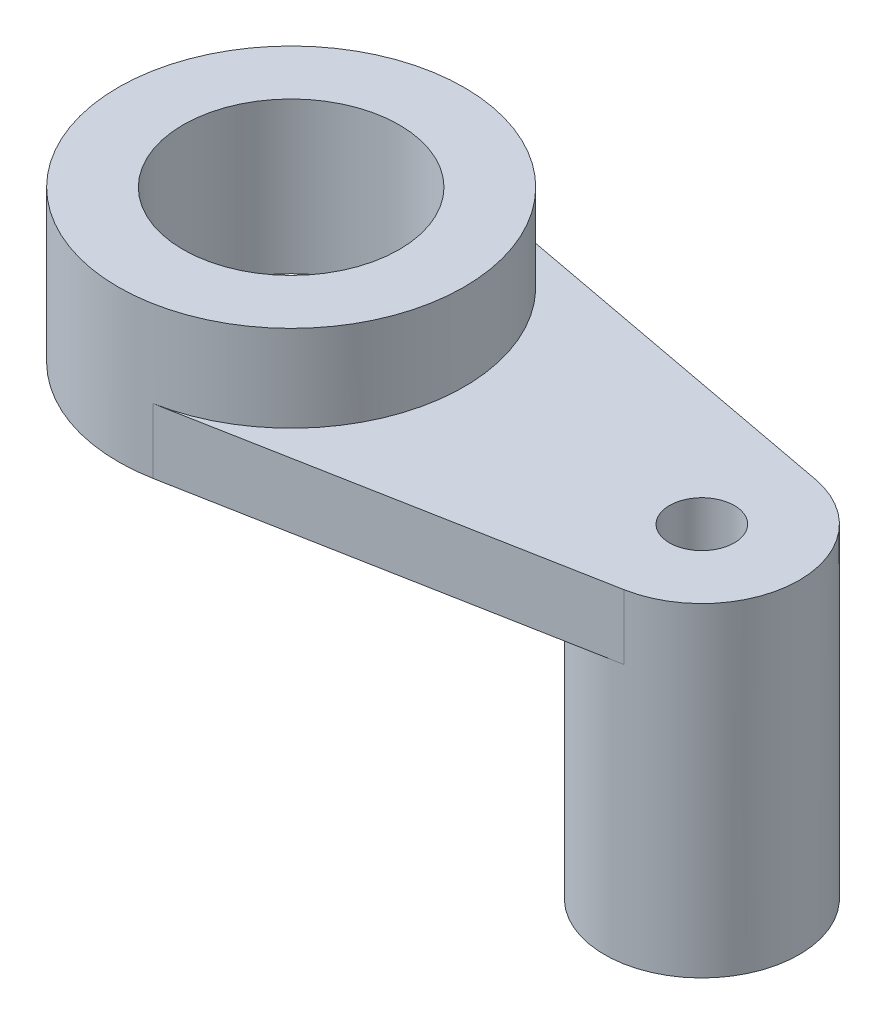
from build123d import *
from build123d.topology import SkipClean

# Parameters (mm, degrees)
SKETCH1_R           = 10
SKETCH1_R_2         = 3
BOSS_EXTRUDE1_DEPTH = 6
SKETCH5_R           = 16
BOSS_EXTRUDE4_DEPTH = 8
SKETCH6_R           = 10
CUT_EXTRUDE1_DEPTH  = 52.584881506
BOSS_EXTRUDE6_START = 24
SKETCH7_R           = 9
BOSS_EXTRUDE6_DEPTH = 24
SKETCH8_R           = 3
CUT_EXTRUDE2_DEPTH  = 63.521996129


with BuildPart() as part:
    # Sketch1 → Boss-Extrude1 (new body)
    with BuildSketch(Plane(origin=(0, 0, 0), x_dir=(1, 0, 0), z_dir=(0, 1, 0))):
        with BuildLine():
            ThreePointArc((39.657894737, -8.845981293), (47, 0), (39.657894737, 8.845981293))
            Line((39.657894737, 8.845981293), (2.947368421, 15.726188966))
            ThreePointArc((2.947368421, 15.726188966), (-16, 0), (2.947368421, -15.726188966))
            Line((2.947368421, -15.726188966), (39.657894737, -8.845981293))
        make_face()
        with Locations(Location((0, 0, 0), (0, 0, 270))):
            Circle(SKETCH1_R, mode=Mode.SUBTRACT)
        with Locations(Location((38, 0, 0), (0, 0, 270))):
            Circle(SKETCH1_R_2, mode=Mode.SUBTRACT)
    extrude(amount=BOSS_EXTRUDE1_DEPTH)

    # Sketch5 → Boss-Extrude4 (add)
    with BuildSketch(Plane(origin=(0, 6, 0), x_dir=(1, 0, 0), z_dir=(0, 1, 0))):
        with Locations(Location((0, 0, 0), (0, 0, 79.384892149))):
            Circle(SKETCH5_R)
    extrude(amount=BOSS_EXTRUDE4_DEPTH)

    # Sketch6 → Cut-Extrude1 (cut, through all)
    with BuildSketch(Plane(origin=(0, 14, 0), x_dir=(1, 0, 0), z_dir=(0, 1, 0))):
        with Locations(Location((0, 0, 0), (0, 0, 270))):
            Circle(SKETCH6_R)
    extrude(amount=-CUT_EXTRUDE1_DEPTH, mode=Mode.SUBTRACT)

    # Sketch7 → Boss-Extrude6 (add)
    with SkipClean():  # the faces are left unmerged after this step: merging them gives an invalid solid
        with BuildSketch(Plane.XZ.offset(BOSS_EXTRUDE6_START)):
            with Locations(Location((38, 0, 0), (0, 0, 270))):
                Circle(SKETCH7_R)
        extrude(amount=-BOSS_EXTRUDE6_DEPTH)

    # Sketch8 → Cut-Extrude2 (cut, through all)
    with SkipClean():  # the faces are left unmerged after this step: merging them gives an invalid solid
        with BuildSketch(Plane.XZ.offset(24)):
            with Locations(Location((38, 0, 0), (0, 0, 270))):
                Circle(SKETCH8_R)
        extrude(amount=-CUT_EXTRUDE2_DEPTH, mode=Mode.SUBTRACT)


solid = part.part
